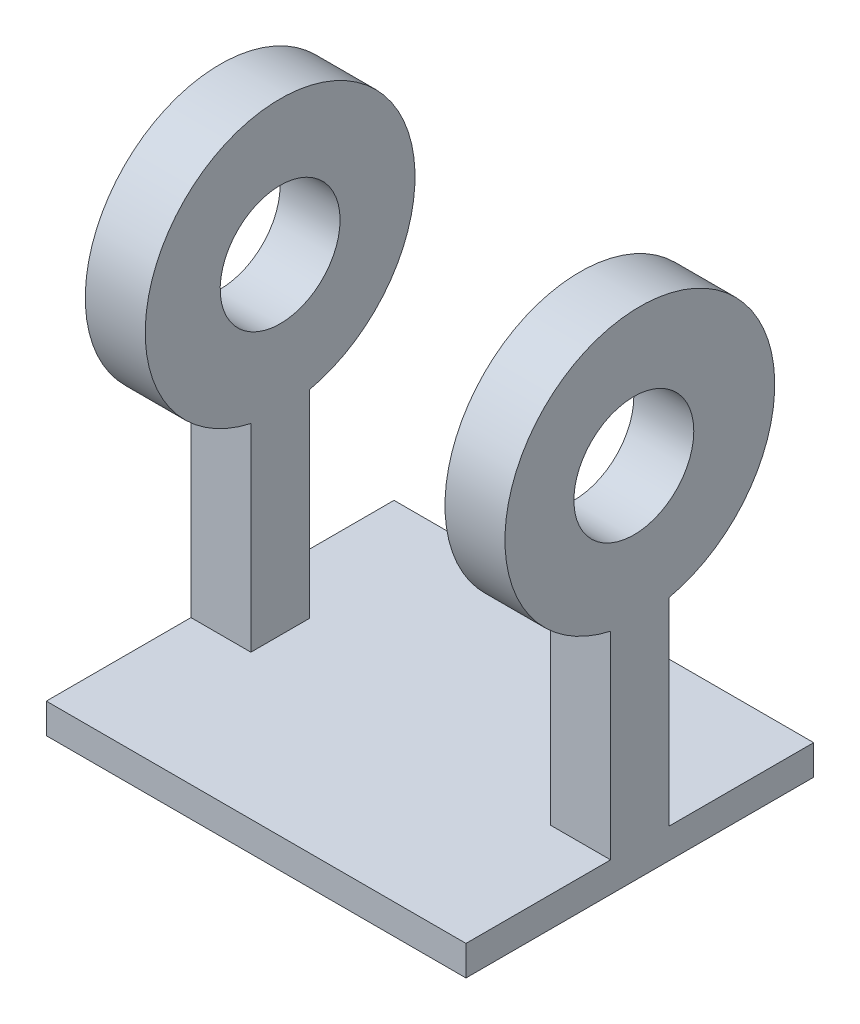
from build123d import *

# Parameters (mm, degrees)
BOSS_EXTRU_1_DEPTH      = 70
ESQUISSE4_R             = 22.5
ESQUISSE4_R_2           = 10
BOSS_EXTRU_2_DEPTH      = 70
ESQUISSE5_W             = 50
ESQUISSE5_H             = 77.5
ENL_V_MAT_EXTRU_3_DEPTH = 43
ESQUISSE8_W             = 50
ESQUISSE8_H             = 43.931053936
ENL_V_MAT_EXTRU_4_DEPTH = 43
ESQUISSE9_R             = 10
BOSS_EXTRU_3_DEPTH      = 10
ESQUISSE10_R            = 10
ENL_V_MAT_EXTRU_5_DEPTH = 10


with BuildPart() as part:
    # Esquisse3 → Boss.-Extru.1 (new body)
    with BuildSketch(Plane(origin=(0, 0, 0), x_dir=(0, 0, -1), z_dir=(1, 0, 0))):
        Polygon((0, 0), (24.125, 0), (24.125, -5), (-33.875, -5), (-33.875, 0), (-9.75, 0), (-9.75, 33.034473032), (0, 33.034473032), align=None)
    extrude(amount=BOSS_EXTRU_1_DEPTH)

    # Esquisse4 → Boss.-Extru.2 (add)
    with BuildSketch(Plane(origin=(70, 0, 0), x_dir=(0, 0, -1), z_dir=(1, 0, 0))):
        with Locations((-4.875, 55)):
            Circle(ESQUISSE4_R)
        with Locations((-4.875, 55)):
            Circle(ESQUISSE4_R_2, mode=Mode.SUBTRACT)
    extrude(amount=-BOSS_EXTRU_2_DEPTH)

    # Esquisse5 → Enl_v. mat.-Extru.3 (cut)
    with BuildSketch(Plane.XY.offset(9.75)):
        with Locations((35, 38.75)):
            Rectangle(ESQUISSE5_W, ESQUISSE5_H)
    extrude(amount=-ENL_V_MAT_EXTRU_3_DEPTH, mode=Mode.SUBTRACT)

    # Esquisse8 → Enl_v. mat.-Extru.4 (cut)
    with BuildSketch(Plane(origin=(0, 0, 9.75), x_dir=(-1, 0, 0), z_dir=(0, 0, -1))):
        with Locations((-35, 55)):
            Rectangle(ESQUISSE8_W, ESQUISSE8_H)
    extrude(amount=-ENL_V_MAT_EXTRU_4_DEPTH, mode=Mode.SUBTRACT)

    # Esquisse9 → Boss.-Extru.3 (add)
    with BuildSketch(Plane(origin=(70, 0, 0), x_dir=(0, 0, -1), z_dir=(1, 0, 0))):
        with Locations((-4.875, 55)):
            Circle(ESQUISSE9_R)
    extrude(amount=-BOSS_EXTRU_3_DEPTH)

    # Esquisse10 → Enl_v. mat.-Extru.5 (cut)
    with BuildSketch(Plane(origin=(70, 0, 0), x_dir=(0, 0, -1), z_dir=(1, 0, 0))):
        with Locations((-5.875, 55)):
            Circle(ESQUISSE10_R)
    extrude(amount=-ENL_V_MAT_EXTRU_5_DEPTH, mode=Mode.SUBTRACT)


solid = part.part
